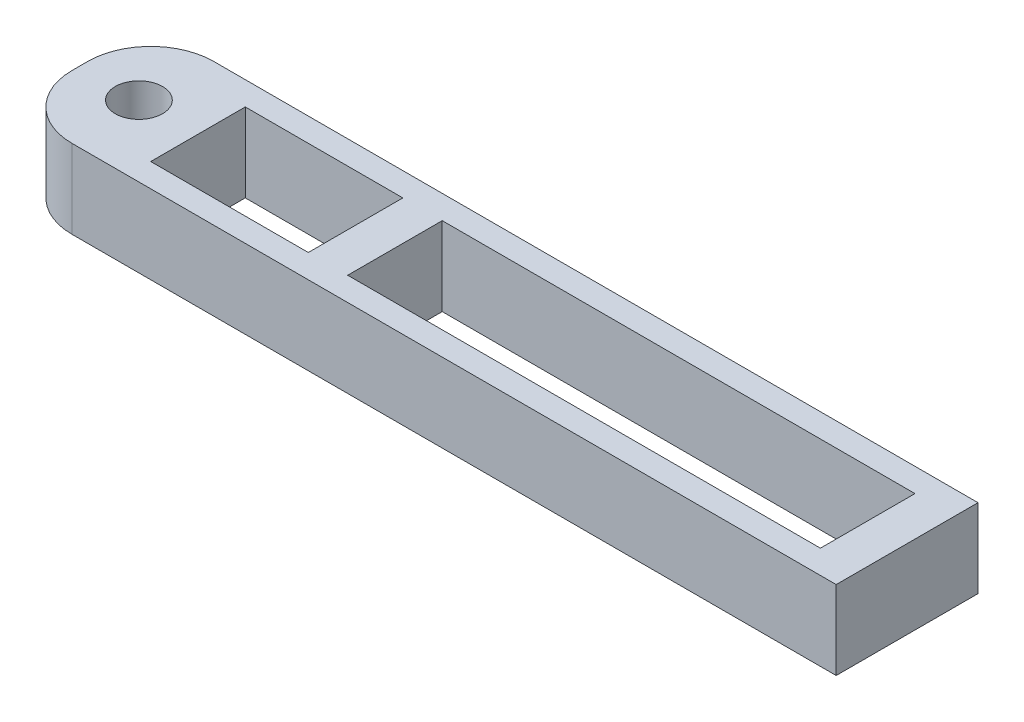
from build123d import *

# Parameters (mm, degrees)
SKETCH1_W           = 18
SKETCH1_H           = 10
BOSS_EXTRUDE1_DEPTH = 15
SKETCH2_R           = 3
CUT_EXTRUDE1_DEPTH  = 26.475478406
SKETCH5_W           = 3
SKETCH5_H           = 10
BOSS_EXTRUDE5_DEPTH = 40
FILLET3_R           = 8
FILLET4_R           = 8
SKETCH6_W           = 3
SKETCH6_H           = 10
BOSS_EXTRUDE6_DEPTH = 50
SKETCH7_W           = 5
SKETCH7_H           = 10
BOSS_EXTRUDE7_DEPTH = 15
SKETCH8_W           = 5
SKETCH8_H           = 10
BOSS_EXTRUDE8_DEPTH = 15


with BuildPart() as part:
    # Sketch1 → Boss-Extrude1 (new body)
    with BuildSketch(Plane(origin=(0, 0, 0), x_dir=(0, 0, -1), z_dir=(1, 0, 0))):
        with Locations((9, 5)):
            Rectangle(SKETCH1_W, SKETCH1_H)
    extrude(amount=BOSS_EXTRUDE1_DEPTH)

    # Sketch2 → Cut-Extrude1 (cut, through all)
    with BuildSketch(Plane(origin=(0, 10, 0), x_dir=(1, 0, 0), z_dir=(0, 1, 0))):
        with Locations(Location((7.5, 9, 0), (0, 0, 270))):
            Circle(SKETCH2_R)
    extrude(amount=-CUT_EXTRUDE1_DEPTH, mode=Mode.SUBTRACT)

    # Sketch5 → Boss-Extrude5 (add)
    with BuildSketch(Plane(origin=(15, 0, 0), x_dir=(0, 0, -1), z_dir=(1, 0, 0))):
        with Locations((1.5, 5)):
            Rectangle(SKETCH5_W, SKETCH5_H)
        with Locations((16.5, 5)):
            Rectangle(SKETCH5_W, SKETCH5_H)
    extrude(amount=BOSS_EXTRUDE5_DEPTH)

    # Fillet3
    fillet3_edges = [part.edges().sort_by_distance(p)[0] for p in [
        (0, 5, 0),
    ]]
    fillet(fillet3_edges, radius=FILLET3_R)

    # Fillet4
    fillet4_edges = [part.edges().sort_by_distance(p)[0] for p in [
        (0, 5, -18),
    ]]
    fillet(fillet4_edges, radius=FILLET4_R)

    # Sketch6 → Boss-Extrude6 (add)
    with BuildSketch(Plane(origin=(55, 0, 0), x_dir=(0, 0, -1), z_dir=(1, 0, 0))):
        with Locations((16.5, 5)):
            Rectangle(SKETCH6_W, SKETCH6_H)
        with Locations((1.5, 5)):
            Rectangle(SKETCH6_W, SKETCH6_H)
    extrude(amount=BOSS_EXTRUDE6_DEPTH)

    # Sketch7 → Boss-Extrude7 (add)
    with BuildSketch(Plane.XY):
        with Locations((102.5, 5)):
            Rectangle(SKETCH7_W, SKETCH7_H)
    extrude(amount=-BOSS_EXTRUDE7_DEPTH)

    # Sketch8 → Boss-Extrude8 (add)
    with BuildSketch(Plane.XY):
        with Locations((37.5, 5)):
            Rectangle(SKETCH8_W, SKETCH8_H)
    extrude(amount=-BOSS_EXTRUDE8_DEPTH)


solid = part.part
